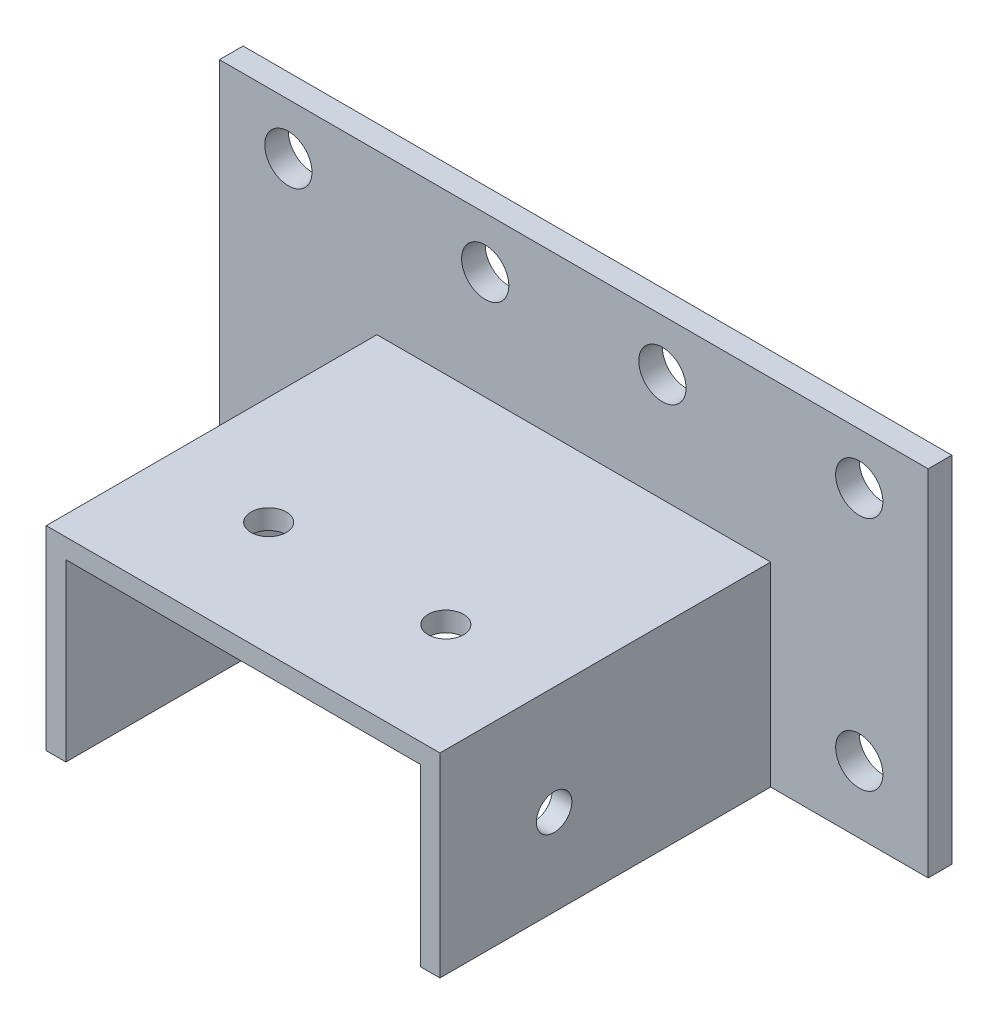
ISO-10303-21;
HEADER;
FILE_DESCRIPTION(('STEP AP214'),'2;1');
FILE_NAME('part.step','',(''),(''),'','','');
FILE_SCHEMA(('AUTOMOTIVE_DESIGN { 1 0 10303 214 1 1 1 1 }'));
ENDSEC;
DATA;
#1=APPLICATION_CONTEXT('core data for automotive mechanical design processes');
#2=APPLICATION_PROTOCOL_DEFINITION('international standard','automotive_design',2000,#1);
#3=PRODUCT_CONTEXT('',#1,'mechanical');
#4=PRODUCT('Part','Part','',(#3));
#5=PRODUCT_RELATED_PRODUCT_CATEGORY('part','',(#4));
#6=PRODUCT_DEFINITION_FORMATION('','',#4);
#7=PRODUCT_DEFINITION_CONTEXT('part definition',#1,'design');
#8=PRODUCT_DEFINITION('design','',#6,#7);
#9=PRODUCT_DEFINITION_SHAPE('','',#8);
#10=(LENGTH_UNIT() NAMED_UNIT(*) SI_UNIT(.MILLI.,.METRE.));
#11=(NAMED_UNIT(*) PLANE_ANGLE_UNIT() SI_UNIT($,.RADIAN.));
#12=(NAMED_UNIT(*) SI_UNIT($,.STERADIAN.) SOLID_ANGLE_UNIT());
#13=UNCERTAINTY_MEASURE_WITH_UNIT(LENGTH_MEASURE(1.E-05),#10,'distance_accuracy_value','');
#14=(GEOMETRIC_REPRESENTATION_CONTEXT(3) GLOBAL_UNCERTAINTY_ASSIGNED_CONTEXT((#13)) GLOBAL_UNIT_ASSIGNED_CONTEXT((#10,
#11,#12)) REPRESENTATION_CONTEXT('',''));
#15=CARTESIAN_POINT('',(0.,0.,0.));
#16=DIRECTION('',(0.,0.,1.));
#17=DIRECTION('',(1.,0.,0.));
#18=AXIS2_PLACEMENT_3D('',#15,#16,#17);
#19=CARTESIAN_POINT('',(-22.5,4.99999999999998,61.));
#20=DIRECTION('',(0.,-1.,0.));
#21=DIRECTION('',(1.,0.,0.));
#22=AXIS2_PLACEMENT_3D('',#19,#20,#21);
#23=CYLINDRICAL_SURFACE('',#22,4.5);
#24=CARTESIAN_POINT('',(-22.5,4.99999999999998,61.));
#25=DIRECTION('',(0.,-1.,0.));
#26=DIRECTION('',(1.,0.,0.));
#27=AXIS2_PLACEMENT_3D('',#24,#25,#26);
#28=CIRCLE('',#27,4.5);
#29=CARTESIAN_POINT('',(-18.,4.99999999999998,61.));
#30=VERTEX_POINT('',#29);
#31=EDGE_CURVE('E333',#30,#30,#28,.T.);
#32=ORIENTED_EDGE('',*,*,#31,.F.);
#33=EDGE_LOOP('',(#32));
#34=FACE_BOUND('',#33,.T.);
#35=CARTESIAN_POINT('',(-22.5,0.,61.));
#36=DIRECTION('',(0.,-1.,0.));
#37=DIRECTION('',(1.,0.,0.));
#38=AXIS2_PLACEMENT_3D('',#35,#36,#37);
#39=CIRCLE('',#38,4.5);
#40=CARTESIAN_POINT('',(-18.,0.,61.));
#41=VERTEX_POINT('',#40);
#42=EDGE_CURVE('E33',#41,#41,#39,.F.);
#43=ORIENTED_EDGE('',*,*,#42,.F.);
#44=EDGE_LOOP('',(#43));
#45=FACE_BOUND('',#44,.T.);
#46=ADVANCED_FACE('F15',(#34,#45),#23,.F.);
#47=CARTESIAN_POINT('',(22.5,4.99999999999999,61.));
#48=DIRECTION('',(0.,-1.,0.));
#49=DIRECTION('',(1.,0.,0.));
#50=AXIS2_PLACEMENT_3D('',#47,#48,#49);
#51=CYLINDRICAL_SURFACE('',#50,4.5);
#52=CARTESIAN_POINT('',(22.5,4.99999999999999,61.));
#53=DIRECTION('',(0.,-1.,0.));
#54=DIRECTION('',(1.,0.,0.));
#55=AXIS2_PLACEMENT_3D('',#52,#53,#54);
#56=CIRCLE('',#55,4.5);
#57=CARTESIAN_POINT('',(27.,4.99999999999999,61.));
#58=VERTEX_POINT('',#57);
#59=EDGE_CURVE('E291',#58,#58,#56,.T.);
#60=ORIENTED_EDGE('',*,*,#59,.F.);
#61=EDGE_LOOP('',(#60));
#62=FACE_BOUND('',#61,.T.);
#63=CARTESIAN_POINT('',(22.5,0.,61.));
#64=DIRECTION('',(0.,-1.,0.));
#65=DIRECTION('',(1.,0.,0.));
#66=AXIS2_PLACEMENT_3D('',#63,#64,#65);
#67=CIRCLE('',#66,4.5);
#68=CARTESIAN_POINT('',(27.,0.,61.));
#69=VERTEX_POINT('',#68);
#70=EDGE_CURVE('E18',#69,#69,#67,.F.);
#71=ORIENTED_EDGE('',*,*,#70,.F.);
#72=EDGE_LOOP('',(#71));
#73=FACE_BOUND('',#72,.T.);
#74=ADVANCED_FACE('F345',(#62,#73),#51,.F.);
#75=CARTESIAN_POINT('',(50.,-22.5,61.));
#76=DIRECTION('',(-1.,0.,0.));
#77=DIRECTION('',(0.,-1.,0.));
#78=AXIS2_PLACEMENT_3D('',#75,#76,#77);
#79=CYLINDRICAL_SURFACE('',#78,4.5);
#80=CARTESIAN_POINT('',(50.,-22.5,61.));
#81=DIRECTION('',(-1.,0.,0.));
#82=DIRECTION('',(0.,-1.,0.));
#83=AXIS2_PLACEMENT_3D('',#80,#81,#82);
#84=CIRCLE('',#83,4.5);
#85=CARTESIAN_POINT('',(50.,-22.5,56.5));
#86=VERTEX_POINT('',#85);
#87=EDGE_CURVE('E289',#86,#86,#84,.T.);
#88=ORIENTED_EDGE('',*,*,#87,.F.);
#89=EDGE_LOOP('',(#88));
#90=FACE_BOUND('',#89,.T.);
#91=CARTESIAN_POINT('',(45.,-22.5,61.));
#92=DIRECTION('',(-1.,0.,0.));
#93=DIRECTION('',(0.,-1.,0.));
#94=AXIS2_PLACEMENT_3D('',#91,#92,#93);
#95=CIRCLE('',#94,4.5);
#96=CARTESIAN_POINT('',(45.,-22.5,56.5));
#97=VERTEX_POINT('',#96);
#98=EDGE_CURVE('E286',#97,#97,#95,.F.);
#99=ORIENTED_EDGE('',*,*,#98,.F.);
#100=EDGE_LOOP('',(#99));
#101=FACE_BOUND('',#100,.T.);
#102=ADVANCED_FACE('F350',(#90,#101),#79,.F.);
#103=CARTESIAN_POINT('',(45.,0.,0.));
#104=DIRECTION('',(0.,-1.,0.));
#105=DIRECTION('',(0.,0.,-1.));
#106=AXIS2_PLACEMENT_3D('',#103,#104,#105);
#107=PLANE('',#106);
#108=ORIENTED_EDGE('',*,*,#42,.T.);
#109=EDGE_LOOP('',(#108));
#110=FACE_BOUND('',#109,.T.);
#111=ORIENTED_EDGE('',*,*,#70,.T.);
#112=EDGE_LOOP('',(#111));
#113=FACE_BOUND('',#112,.T.);
#114=DIRECTION('',(1.,0.,0.));
#115=VECTOR('',#114,1.);
#116=CARTESIAN_POINT('',(0.,0.,90.));
#117=LINE('',#116,#115);
#118=CARTESIAN_POINT('',(-45.,0.,90.));
#119=VERTEX_POINT('',#118);
#120=CARTESIAN_POINT('',(45.,0.,90.));
#121=VERTEX_POINT('',#120);
#122=EDGE_CURVE('E268',#119,#121,#117,.T.);
#123=ORIENTED_EDGE('',*,*,#122,.F.);
#124=DIRECTION('',(0.,0.,-1.));
#125=VECTOR('',#124,1.);
#126=CARTESIAN_POINT('',(-45.,0.,0.));
#127=LINE('',#126,#125);
#128=CARTESIAN_POINT('',(-45.,0.,6.));
#129=VERTEX_POINT('',#128);
#130=EDGE_CURVE('E274',#129,#119,#127,.F.);
#131=ORIENTED_EDGE('',*,*,#130,.F.);
#132=DIRECTION('',(1.,0.,0.));
#133=VECTOR('',#132,1.);
#134=CARTESIAN_POINT('',(0.,0.,6.));
#135=LINE('',#134,#133);
#136=CARTESIAN_POINT('',(45.,0.,6.));
#137=VERTEX_POINT('',#136);
#138=EDGE_CURVE('E280',#137,#129,#135,.F.);
#139=ORIENTED_EDGE('',*,*,#138,.F.);
#140=DIRECTION('',(0.,0.,1.));
#141=VECTOR('',#140,1.);
#142=CARTESIAN_POINT('',(45.,0.,0.));
#143=LINE('',#142,#141);
#144=EDGE_CURVE('E287',#121,#137,#143,.F.);
#145=ORIENTED_EDGE('',*,*,#144,.F.);
#146=EDGE_LOOP('',(#123,#131,#139,#145));
#147=FACE_BOUND('',#146,.T.);
#148=ADVANCED_FACE('F429',(#110,#113,#147),#107,.T.);
#149=CARTESIAN_POINT('',(50.,-22.5,61.));
#150=DIRECTION('',(-1.,0.,0.));
#151=DIRECTION('',(0.,-1.,0.));
#152=AXIS2_PLACEMENT_3D('',#149,#150,#151);
#153=CYLINDRICAL_SURFACE('',#152,4.5);
#154=CARTESIAN_POINT('',(-50.,-22.5,61.));
#155=DIRECTION('',(-1.,0.,0.));
#156=DIRECTION('',(0.,-1.,0.));
#157=AXIS2_PLACEMENT_3D('',#154,#155,#156);
#158=CIRCLE('',#157,4.5);
#159=CARTESIAN_POINT('',(-50.,-22.5,56.5));
#160=VERTEX_POINT('',#159);
#161=EDGE_CURVE('E251',#160,#160,#158,.F.);
#162=ORIENTED_EDGE('',*,*,#161,.F.);
#163=EDGE_LOOP('',(#162));
#164=FACE_BOUND('',#163,.T.);
#165=CARTESIAN_POINT('',(-45.,-22.5,61.));
#166=DIRECTION('',(-1.,0.,0.));
#167=DIRECTION('',(0.,-1.,0.));
#168=AXIS2_PLACEMENT_3D('',#165,#166,#167);
#169=CIRCLE('',#168,4.5);
#170=CARTESIAN_POINT('',(-45.,-22.5,56.5));
#171=VERTEX_POINT('',#170);
#172=EDGE_CURVE('E273',#171,#171,#169,.T.);
#173=ORIENTED_EDGE('',*,*,#172,.F.);
#174=EDGE_LOOP('',(#173));
#175=FACE_BOUND('',#174,.T.);
#176=ADVANCED_FACE('F425',(#164,#175),#153,.F.);
#177=CARTESIAN_POINT('',(-50.,4.99999999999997,6.));
#178=DIRECTION('',(0.,1.,0.));
#179=DIRECTION('',(0.,0.,1.));
#180=AXIS2_PLACEMENT_3D('',#177,#178,#179);
#181=PLANE('',#180);
#182=ORIENTED_EDGE('',*,*,#59,.T.);
#183=EDGE_LOOP('',(#182));
#184=FACE_BOUND('',#183,.T.);
#185=ORIENTED_EDGE('',*,*,#31,.T.);
#186=EDGE_LOOP('',(#185));
#187=FACE_BOUND('',#186,.T.);
#188=DIRECTION('',(1.,0.,0.));
#189=VECTOR('',#188,1.);
#190=CARTESIAN_POINT('',(0.,4.99999999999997,6.));
#191=LINE('',#190,#189);
#192=CARTESIAN_POINT('',(-50.,4.99999999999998,6.));
#193=VERTEX_POINT('',#192);
#194=CARTESIAN_POINT('',(50.,4.99999999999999,6.));
#195=VERTEX_POINT('',#194);
#196=EDGE_CURVE('E243',#193,#195,#191,.T.);
#197=ORIENTED_EDGE('',*,*,#196,.F.);
#198=DIRECTION('',(0.,0.,1.));
#199=VECTOR('',#198,1.);
#200=CARTESIAN_POINT('',(-50.,4.99999999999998,6.));
#201=LINE('',#200,#199);
#202=CARTESIAN_POINT('',(-50.,4.99999999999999,90.));
#203=VERTEX_POINT('',#202);
#204=EDGE_CURVE('E252',#203,#193,#201,.F.);
#205=ORIENTED_EDGE('',*,*,#204,.F.);
#206=DIRECTION('',(1.,0.,0.));
#207=VECTOR('',#206,1.);
#208=CARTESIAN_POINT('',(0.,5.,90.));
#209=LINE('',#208,#207);
#210=CARTESIAN_POINT('',(50.,4.99999999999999,90.));
#211=VERTEX_POINT('',#210);
#212=EDGE_CURVE('E258',#211,#203,#209,.F.);
#213=ORIENTED_EDGE('',*,*,#212,.F.);
#214=DIRECTION('',(0.,0.,-1.));
#215=VECTOR('',#214,1.);
#216=CARTESIAN_POINT('',(50.,5.,6.));
#217=LINE('',#216,#215);
#218=EDGE_CURVE('E290',#195,#211,#217,.F.);
#219=ORIENTED_EDGE('',*,*,#218,.F.);
#220=EDGE_LOOP('',(#197,#205,#213,#219));
#221=FACE_BOUND('',#220,.T.);
#222=ADVANCED_FACE('F340',(#184,#187,#221),#181,.T.);
#223=CARTESIAN_POINT('',(50.,5.,6.));
#224=DIRECTION('',(1.,0.,0.));
#225=DIRECTION('',(0.,0.,-1.));
#226=AXIS2_PLACEMENT_3D('',#223,#224,#225);
#227=PLANE('',#226);
#228=ORIENTED_EDGE('',*,*,#87,.T.);
#229=EDGE_LOOP('',(#228));
#230=FACE_BOUND('',#229,.T.);
#231=DIRECTION('',(0.,1.,0.));
#232=VECTOR('',#231,1.);
#233=CARTESIAN_POINT('',(50.,3.64825119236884,6.));
#234=LINE('',#233,#232);
#235=CARTESIAN_POINT('',(50.,-44.5,6.));
#236=VERTEX_POINT('',#235);
#237=EDGE_CURVE('E249',#195,#236,#234,.F.);
#238=ORIENTED_EDGE('',*,*,#237,.F.);
#239=ORIENTED_EDGE('',*,*,#218,.T.);
#240=DIRECTION('',(0.,1.,0.));
#241=VECTOR('',#240,1.);
#242=CARTESIAN_POINT('',(50.,-10.0012886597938,90.));
#243=LINE('',#242,#241);
#244=CARTESIAN_POINT('',(50.,-44.5,90.));
#245=VERTEX_POINT('',#244);
#246=EDGE_CURVE('E261',#245,#211,#243,.T.);
#247=ORIENTED_EDGE('',*,*,#246,.F.);
#248=DIRECTION('',(0.,0.,-1.));
#249=VECTOR('',#248,1.);
#250=CARTESIAN_POINT('',(50.,-44.5,0.));
#251=LINE('',#250,#249);
#252=EDGE_CURVE('E234',#236,#245,#251,.F.);
#253=ORIENTED_EDGE('',*,*,#252,.F.);
#254=EDGE_LOOP('',(#238,#239,#247,#253));
#255=FACE_BOUND('',#254,.T.);
#256=ADVANCED_FACE('F418',(#230,#255),#227,.T.);
#257=CARTESIAN_POINT('',(45.,-44.5,0.));
#258=DIRECTION('',(-1.,0.,0.));
#259=DIRECTION('',(0.,0.,1.));
#260=AXIS2_PLACEMENT_3D('',#257,#258,#259);
#261=PLANE('',#260);
#262=ORIENTED_EDGE('',*,*,#98,.T.);
#263=EDGE_LOOP('',(#262));
#264=FACE_BOUND('',#263,.T.);
#265=DIRECTION('',(0.,1.,0.));
#266=VECTOR('',#265,1.);
#267=CARTESIAN_POINT('',(45.,-10.0012886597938,90.));
#268=LINE('',#267,#266);
#269=CARTESIAN_POINT('',(45.,-44.5,90.));
#270=VERTEX_POINT('',#269);
#271=EDGE_CURVE('E265',#121,#270,#268,.F.);
#272=ORIENTED_EDGE('',*,*,#271,.F.);
#273=ORIENTED_EDGE('',*,*,#144,.T.);
#274=DIRECTION('',(0.,1.,0.));
#275=VECTOR('',#274,1.);
#276=CARTESIAN_POINT('',(45.,-22.25,6.));
#277=LINE('',#276,#275);
#278=CARTESIAN_POINT('',(45.,-44.5,6.));
#279=VERTEX_POINT('',#278);
#280=EDGE_CURVE('E282',#279,#137,#277,.T.);
#281=ORIENTED_EDGE('',*,*,#280,.F.);
#282=DIRECTION('',(0.,0.,-1.));
#283=VECTOR('',#282,1.);
#284=CARTESIAN_POINT('',(45.,-44.5,0.));
#285=LINE('',#284,#283);
#286=EDGE_CURVE('E227',#270,#279,#285,.T.);
#287=ORIENTED_EDGE('',*,*,#286,.F.);
#288=EDGE_LOOP('',(#272,#273,#281,#287));
#289=FACE_BOUND('',#288,.T.);
#290=ADVANCED_FACE('F414',(#264,#289),#261,.T.);
#291=CARTESIAN_POINT('',(0.,-22.25,6.));
#292=DIRECTION('',(0.,0.,1.));
#293=DIRECTION('',(1.,0.,0.));
#294=AXIS2_PLACEMENT_3D('',#291,#292,#293);
#295=PLANE('',#294);
#296=ORIENTED_EDGE('',*,*,#280,.T.);
#297=ORIENTED_EDGE('',*,*,#138,.T.);
#298=DIRECTION('',(0.,1.,0.));
#299=VECTOR('',#298,1.);
#300=CARTESIAN_POINT('',(-45.,0.,6.));
#301=LINE('',#300,#299);
#302=CARTESIAN_POINT('',(-45.,-44.5,6.));
#303=VERTEX_POINT('',#302);
#304=EDGE_CURVE('E277',#303,#129,#301,.T.);
#305=ORIENTED_EDGE('',*,*,#304,.F.);
#306=DIRECTION('',(1.,0.,0.));
#307=VECTOR('',#306,1.);
#308=CARTESIAN_POINT('',(-45.,-44.5,6.));
#309=LINE('',#308,#307);
#310=EDGE_CURVE('E224',#279,#303,#309,.F.);
#311=ORIENTED_EDGE('',*,*,#310,.F.);
#312=EDGE_LOOP('',(#296,#297,#305,#311));
#313=FACE_BOUND('',#312,.T.);
#314=ADVANCED_FACE('F410',(#313),#295,.T.);
#315=CARTESIAN_POINT('',(-45.,0.,0.));
#316=DIRECTION('',(1.,0.,0.));
#317=DIRECTION('',(0.,0.,-1.));
#318=AXIS2_PLACEMENT_3D('',#315,#316,#317);
#319=PLANE('',#318);
#320=ORIENTED_EDGE('',*,*,#172,.T.);
#321=EDGE_LOOP('',(#320));
#322=FACE_BOUND('',#321,.T.);
#323=DIRECTION('',(0.,1.,0.));
#324=VECTOR('',#323,1.);
#325=CARTESIAN_POINT('',(-45.,-10.0012886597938,90.));
#326=LINE('',#325,#324);
#327=CARTESIAN_POINT('',(-45.,-44.5,90.));
#328=VERTEX_POINT('',#327);
#329=EDGE_CURVE('E270',#328,#119,#326,.T.);
#330=ORIENTED_EDGE('',*,*,#329,.F.);
#331=DIRECTION('',(0.,0.,-1.));
#332=VECTOR('',#331,1.);
#333=CARTESIAN_POINT('',(-45.,-44.5,0.));
#334=LINE('',#333,#332);
#335=EDGE_CURVE('E222',#303,#328,#334,.F.);
#336=ORIENTED_EDGE('',*,*,#335,.F.);
#337=ORIENTED_EDGE('',*,*,#304,.T.);
#338=ORIENTED_EDGE('',*,*,#130,.T.);
#339=EDGE_LOOP('',(#330,#336,#337,#338));
#340=FACE_BOUND('',#339,.T.);
#341=ADVANCED_FACE('F406',(#322,#340),#319,.T.);
#342=CARTESIAN_POINT('',(0.,-10.0012886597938,90.));
#343=DIRECTION('',(0.,0.,1.));
#344=DIRECTION('',(1.,0.,0.));
#345=AXIS2_PLACEMENT_3D('',#342,#343,#344);
#346=PLANE('',#345);
#347=ORIENTED_EDGE('',*,*,#212,.T.);
#348=DIRECTION('',(0.,1.,0.));
#349=VECTOR('',#348,1.);
#350=CARTESIAN_POINT('',(-50.,-44.5,90.));
#351=LINE('',#350,#349);
#352=CARTESIAN_POINT('',(-50.,-44.5,90.));
#353=VERTEX_POINT('',#352);
#354=EDGE_CURVE('E255',#353,#203,#351,.T.);
#355=ORIENTED_EDGE('',*,*,#354,.F.);
#356=DIRECTION('',(1.,0.,0.));
#357=VECTOR('',#356,1.);
#358=CARTESIAN_POINT('',(-45.,-44.5,90.));
#359=LINE('',#358,#357);
#360=EDGE_CURVE('E220',#328,#353,#359,.F.);
#361=ORIENTED_EDGE('',*,*,#360,.F.);
#362=ORIENTED_EDGE('',*,*,#329,.T.);
#363=ORIENTED_EDGE('',*,*,#122,.T.);
#364=ORIENTED_EDGE('',*,*,#271,.T.);
#365=DIRECTION('',(1.,0.,0.));
#366=VECTOR('',#365,1.);
#367=CARTESIAN_POINT('',(-45.,-44.5,90.));
#368=LINE('',#367,#366);
#369=EDGE_CURVE('E230',#245,#270,#368,.F.);
#370=ORIENTED_EDGE('',*,*,#369,.F.);
#371=ORIENTED_EDGE('',*,*,#246,.T.);
#372=EDGE_LOOP('',(#347,#355,#361,#362,#363,#364,#370,#371));
#373=FACE_BOUND('',#372,.T.);
#374=ADVANCED_FACE('F402',(#373),#346,.T.);
#375=CARTESIAN_POINT('',(-50.,-44.5,6.));
#376=DIRECTION('',(-1.,0.,0.));
#377=DIRECTION('',(0.,0.,1.));
#378=AXIS2_PLACEMENT_3D('',#375,#376,#377);
#379=PLANE('',#378);
#380=ORIENTED_EDGE('',*,*,#161,.T.);
#381=EDGE_LOOP('',(#380));
#382=FACE_BOUND('',#381,.T.);
#383=DIRECTION('',(0.,1.,0.));
#384=VECTOR('',#383,1.);
#385=CARTESIAN_POINT('',(-50.,3.64825119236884,6.));
#386=LINE('',#385,#384);
#387=CARTESIAN_POINT('',(-50.,-44.5,6.));
#388=VERTEX_POINT('',#387);
#389=EDGE_CURVE('E246',#388,#193,#386,.T.);
#390=ORIENTED_EDGE('',*,*,#389,.F.);
#391=DIRECTION('',(0.,0.,-1.));
#392=VECTOR('',#391,1.);
#393=CARTESIAN_POINT('',(-50.,-44.5,0.));
#394=LINE('',#393,#392);
#395=EDGE_CURVE('E216',#353,#388,#394,.T.);
#396=ORIENTED_EDGE('',*,*,#395,.F.);
#397=ORIENTED_EDGE('',*,*,#354,.T.);
#398=ORIENTED_EDGE('',*,*,#204,.T.);
#399=EDGE_LOOP('',(#390,#396,#397,#398));
#400=FACE_BOUND('',#399,.T.);
#401=ADVANCED_FACE('F398',(#382,#400),#379,.T.);
#402=CARTESIAN_POINT('',(0.,3.64825119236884,6.));
#403=DIRECTION('',(0.,0.,1.));
#404=DIRECTION('',(1.,0.,0.));
#405=AXIS2_PLACEMENT_3D('',#402,#403,#404);
#406=PLANE('',#405);
#407=CARTESIAN_POINT('',(-72.5,-27.5,6.));
#408=DIRECTION('',(0.,0.,1.));
#409=DIRECTION('',(1.,0.,0.));
#410=AXIS2_PLACEMENT_3D('',#407,#408,#409);
#411=CIRCLE('',#410,6.);
#412=CARTESIAN_POINT('',(-66.5,-27.5,6.));
#413=VERTEX_POINT('',#412);
#414=EDGE_CURVE('E203',#413,#413,#411,.F.);
#415=ORIENTED_EDGE('',*,*,#414,.T.);
#416=EDGE_LOOP('',(#415));
#417=FACE_BOUND('',#416,.T.);
#418=CARTESIAN_POINT('',(-72.5,32.5,6.));
#419=DIRECTION('',(0.,0.,1.));
#420=DIRECTION('',(1.,0.,0.));
#421=AXIS2_PLACEMENT_3D('',#418,#419,#420);
#422=CIRCLE('',#421,6.);
#423=CARTESIAN_POINT('',(-66.5,32.5,6.));
#424=VERTEX_POINT('',#423);
#425=EDGE_CURVE('E310',#424,#424,#422,.F.);
#426=ORIENTED_EDGE('',*,*,#425,.T.);
#427=EDGE_LOOP('',(#426));
#428=FACE_BOUND('',#427,.T.);
#429=CARTESIAN_POINT('',(-22.5,32.5,6.));
#430=DIRECTION('',(0.,0.,1.));
#431=DIRECTION('',(1.,0.,0.));
#432=AXIS2_PLACEMENT_3D('',#429,#430,#431);
#433=CIRCLE('',#432,6.);
#434=CARTESIAN_POINT('',(-16.5,32.5,6.));
#435=VERTEX_POINT('',#434);
#436=EDGE_CURVE('E313',#435,#435,#433,.F.);
#437=ORIENTED_EDGE('',*,*,#436,.T.);
#438=EDGE_LOOP('',(#437));
#439=FACE_BOUND('',#438,.T.);
#440=CARTESIAN_POINT('',(22.5,32.5,6.));
#441=DIRECTION('',(0.,0.,1.));
#442=DIRECTION('',(1.,0.,0.));
#443=AXIS2_PLACEMENT_3D('',#440,#441,#442);
#444=CIRCLE('',#443,6.);
#445=CARTESIAN_POINT('',(28.5,32.5,6.));
#446=VERTEX_POINT('',#445);
#447=EDGE_CURVE('E316',#446,#446,#444,.F.);
#448=ORIENTED_EDGE('',*,*,#447,.T.);
#449=EDGE_LOOP('',(#448));
#450=FACE_BOUND('',#449,.T.);
#451=CARTESIAN_POINT('',(72.5,32.5,6.));
#452=DIRECTION('',(0.,0.,1.));
#453=DIRECTION('',(1.,0.,0.));
#454=AXIS2_PLACEMENT_3D('',#451,#452,#453);
#455=CIRCLE('',#454,6.);
#456=CARTESIAN_POINT('',(78.5,32.5,6.));
#457=VERTEX_POINT('',#456);
#458=EDGE_CURVE('E320',#457,#457,#455,.F.);
#459=ORIENTED_EDGE('',*,*,#458,.T.);
#460=EDGE_LOOP('',(#459));
#461=FACE_BOUND('',#460,.T.);
#462=CARTESIAN_POINT('',(72.5,-27.5,6.));
#463=DIRECTION('',(0.,0.,1.));
#464=DIRECTION('',(1.,0.,0.));
#465=AXIS2_PLACEMENT_3D('',#462,#463,#464);
#466=CIRCLE('',#465,6.);
#467=CARTESIAN_POINT('',(78.5,-27.5,6.));
#468=VERTEX_POINT('',#467);
#469=EDGE_CURVE('E205',#468,#468,#466,.F.);
#470=ORIENTED_EDGE('',*,*,#469,.T.);
#471=EDGE_LOOP('',(#470));
#472=FACE_BOUND('',#471,.T.);
#473=ORIENTED_EDGE('',*,*,#389,.T.);
#474=ORIENTED_EDGE('',*,*,#196,.T.);
#475=ORIENTED_EDGE('',*,*,#237,.T.);
#476=DIRECTION('',(1.,0.,0.));
#477=VECTOR('',#476,1.);
#478=CARTESIAN_POINT('',(-45.,-44.5,6.));
#479=LINE('',#478,#477);
#480=CARTESIAN_POINT('',(90.,-44.5,6.));
#481=VERTEX_POINT('',#480);
#482=EDGE_CURVE('E237',#481,#236,#479,.F.);
#483=ORIENTED_EDGE('',*,*,#482,.F.);
#484=DIRECTION('',(0.,1.,0.));
#485=VECTOR('',#484,1.);
#486=CARTESIAN_POINT('',(90.,45.5,6.));
#487=LINE('',#486,#485);
#488=CARTESIAN_POINT('',(90.,45.5,6.));
#489=VERTEX_POINT('',#488);
#490=EDGE_CURVE('E214',#489,#481,#487,.F.);
#491=ORIENTED_EDGE('',*,*,#490,.F.);
#492=DIRECTION('',(1.,0.,0.));
#493=VECTOR('',#492,1.);
#494=CARTESIAN_POINT('',(-90.,45.5,6.));
#495=LINE('',#494,#493);
#496=CARTESIAN_POINT('',(-90.,45.5,6.));
#497=VERTEX_POINT('',#496);
#498=EDGE_CURVE('E210',#497,#489,#495,.T.);
#499=ORIENTED_EDGE('',*,*,#498,.F.);
#500=DIRECTION('',(0.,1.,0.));
#501=VECTOR('',#500,1.);
#502=CARTESIAN_POINT('',(-90.,-44.5,6.));
#503=LINE('',#502,#501);
#504=CARTESIAN_POINT('',(-90.,-44.5,6.));
#505=VERTEX_POINT('',#504);
#506=EDGE_CURVE('E176',#505,#497,#503,.T.);
#507=ORIENTED_EDGE('',*,*,#506,.F.);
#508=DIRECTION('',(1.,0.,0.));
#509=VECTOR('',#508,1.);
#510=CARTESIAN_POINT('',(-45.,-44.5,6.));
#511=LINE('',#510,#509);
#512=EDGE_CURVE('E240',#388,#505,#511,.F.);
#513=ORIENTED_EDGE('',*,*,#512,.F.);
#514=EDGE_LOOP('',(#473,#474,#475,#483,#491,#499,#507,#513));
#515=FACE_BOUND('',#514,.T.);
#516=ADVANCED_FACE('F394',(#417,#428,#439,#450,#461,#472,#515),#406,.T.);
#517=CARTESIAN_POINT('',(-45.,-44.5,0.));
#518=DIRECTION('',(0.,-1.,0.));
#519=DIRECTION('',(0.,0.,-1.));
#520=AXIS2_PLACEMENT_3D('',#517,#518,#519);
#521=PLANE('',#520);
#522=ORIENTED_EDGE('',*,*,#360,.T.);
#523=ORIENTED_EDGE('',*,*,#395,.T.);
#524=ORIENTED_EDGE('',*,*,#512,.T.);
#525=DIRECTION('',(0.,0.,1.));
#526=VECTOR('',#525,1.);
#527=CARTESIAN_POINT('',(-90.,-44.5,0.));
#528=LINE('',#527,#526);
#529=CARTESIAN_POINT('',(-90.,-44.5,0.));
#530=VERTEX_POINT('',#529);
#531=EDGE_CURVE('E180',#530,#505,#528,.T.);
#532=ORIENTED_EDGE('',*,*,#531,.F.);
#533=DIRECTION('',(1.,0.,0.));
#534=VECTOR('',#533,1.);
#535=CARTESIAN_POINT('',(0.,-44.5,0.));
#536=LINE('',#535,#534);
#537=CARTESIAN_POINT('',(90.,-44.5,0.));
#538=VERTEX_POINT('',#537);
#539=EDGE_CURVE('E189',#530,#538,#536,.T.);
#540=ORIENTED_EDGE('',*,*,#539,.T.);
#541=DIRECTION('',(0.,0.,-1.));
#542=VECTOR('',#541,1.);
#543=CARTESIAN_POINT('',(90.,-44.5,0.));
#544=LINE('',#543,#542);
#545=EDGE_CURVE('E212',#481,#538,#544,.T.);
#546=ORIENTED_EDGE('',*,*,#545,.F.);
#547=ORIENTED_EDGE('',*,*,#482,.T.);
#548=ORIENTED_EDGE('',*,*,#252,.T.);
#549=ORIENTED_EDGE('',*,*,#369,.T.);
#550=ORIENTED_EDGE('',*,*,#286,.T.);
#551=ORIENTED_EDGE('',*,*,#310,.T.);
#552=ORIENTED_EDGE('',*,*,#335,.T.);
#553=EDGE_LOOP('',(#522,#523,#524,#532,#540,#546,#547,#548,#549,#550,#551,#552));
#554=FACE_BOUND('',#553,.T.);
#555=ADVANCED_FACE('F390',(#554),#521,.T.);
#556=CARTESIAN_POINT('',(90.,45.5,0.));
#557=DIRECTION('',(1.,0.,0.));
#558=DIRECTION('',(0.,0.,-1.));
#559=AXIS2_PLACEMENT_3D('',#556,#557,#558);
#560=PLANE('',#559);
#561=DIRECTION('',(0.,1.,0.));
#562=VECTOR('',#561,1.);
#563=CARTESIAN_POINT('',(90.,3.64825119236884,0.));
#564=LINE('',#563,#562);
#565=CARTESIAN_POINT('',(90.,45.5,0.));
#566=VERTEX_POINT('',#565);
#567=EDGE_CURVE('E197',#538,#566,#564,.T.);
#568=ORIENTED_EDGE('',*,*,#567,.T.);
#569=DIRECTION('',(0.,0.,1.));
#570=VECTOR('',#569,1.);
#571=CARTESIAN_POINT('',(90.,45.5,0.));
#572=LINE('',#571,#570);
#573=EDGE_CURVE('E196',#489,#566,#572,.F.);
#574=ORIENTED_EDGE('',*,*,#573,.F.);
#575=ORIENTED_EDGE('',*,*,#490,.T.);
#576=ORIENTED_EDGE('',*,*,#545,.T.);
#577=EDGE_LOOP('',(#568,#574,#575,#576));
#578=FACE_BOUND('',#577,.T.);
#579=ADVANCED_FACE('F387',(#578),#560,.T.);
#580=CARTESIAN_POINT('',(-90.,45.5,0.));
#581=DIRECTION('',(0.,1.,0.));
#582=DIRECTION('',(0.,0.,1.));
#583=AXIS2_PLACEMENT_3D('',#580,#581,#582);
#584=PLANE('',#583);
#585=DIRECTION('',(1.,0.,0.));
#586=VECTOR('',#585,1.);
#587=CARTESIAN_POINT('',(0.,45.5,0.));
#588=LINE('',#587,#586);
#589=CARTESIAN_POINT('',(-90.,45.5,0.));
#590=VERTEX_POINT('',#589);
#591=EDGE_CURVE('E186',#566,#590,#588,.F.);
#592=ORIENTED_EDGE('',*,*,#591,.T.);
#593=DIRECTION('',(0.,0.,1.));
#594=VECTOR('',#593,1.);
#595=CARTESIAN_POINT('',(-90.,45.5,0.));
#596=LINE('',#595,#594);
#597=EDGE_CURVE('E170',#497,#590,#596,.F.);
#598=ORIENTED_EDGE('',*,*,#597,.F.);
#599=ORIENTED_EDGE('',*,*,#498,.T.);
#600=ORIENTED_EDGE('',*,*,#573,.T.);
#601=EDGE_LOOP('',(#592,#598,#599,#600));
#602=FACE_BOUND('',#601,.T.);
#603=ADVANCED_FACE('F194',(#602),#584,.T.);
#604=CARTESIAN_POINT('',(-90.,-44.5,0.));
#605=DIRECTION('',(-1.,0.,0.));
#606=DIRECTION('',(0.,0.,1.));
#607=AXIS2_PLACEMENT_3D('',#604,#605,#606);
#608=PLANE('',#607);
#609=DIRECTION('',(0.,1.,0.));
#610=VECTOR('',#609,1.);
#611=CARTESIAN_POINT('',(-90.,3.64825119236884,0.));
#612=LINE('',#611,#610);
#613=EDGE_CURVE('E174',#590,#530,#612,.F.);
#614=ORIENTED_EDGE('',*,*,#613,.T.);
#615=ORIENTED_EDGE('',*,*,#531,.T.);
#616=ORIENTED_EDGE('',*,*,#506,.T.);
#617=ORIENTED_EDGE('',*,*,#597,.T.);
#618=EDGE_LOOP('',(#614,#615,#616,#617));
#619=FACE_BOUND('',#618,.T.);
#620=ADVANCED_FACE('F172',(#619),#608,.T.);
#621=CARTESIAN_POINT('',(72.5,-27.5,0.));
#622=DIRECTION('',(0.,0.,1.));
#623=DIRECTION('',(1.,0.,0.));
#624=AXIS2_PLACEMENT_3D('',#621,#622,#623);
#625=CYLINDRICAL_SURFACE('',#624,6.);
#626=CARTESIAN_POINT('',(72.5,-27.5,0.));
#627=DIRECTION('',(0.,0.,1.));
#628=DIRECTION('',(1.,0.,0.));
#629=AXIS2_PLACEMENT_3D('',#626,#627,#628);
#630=CIRCLE('',#629,6.);
#631=CARTESIAN_POINT('',(78.5,-27.5,0.));
#632=VERTEX_POINT('',#631);
#633=EDGE_CURVE('E192',#632,#632,#630,.F.);
#634=ORIENTED_EDGE('',*,*,#633,.T.);
#635=EDGE_LOOP('',(#634));
#636=FACE_BOUND('',#635,.T.);
#637=ORIENTED_EDGE('',*,*,#469,.F.);
#638=EDGE_LOOP('',(#637));
#639=FACE_BOUND('',#638,.T.);
#640=ADVANCED_FACE('F378',(#636,#639),#625,.F.);
#641=CARTESIAN_POINT('',(72.5,32.5,0.));
#642=DIRECTION('',(0.,0.,1.));
#643=DIRECTION('',(1.,0.,0.));
#644=AXIS2_PLACEMENT_3D('',#641,#642,#643);
#645=CYLINDRICAL_SURFACE('',#644,6.);
#646=CARTESIAN_POINT('',(72.5,32.5,0.));
#647=DIRECTION('',(0.,0.,1.));
#648=DIRECTION('',(1.,0.,0.));
#649=AXIS2_PLACEMENT_3D('',#646,#647,#648);
#650=CIRCLE('',#649,6.);
#651=CARTESIAN_POINT('',(78.5,32.5,0.));
#652=VERTEX_POINT('',#651);
#653=EDGE_CURVE('E302',#652,#652,#650,.F.);
#654=ORIENTED_EDGE('',*,*,#653,.T.);
#655=EDGE_LOOP('',(#654));
#656=FACE_BOUND('',#655,.T.);
#657=ORIENTED_EDGE('',*,*,#458,.F.);
#658=EDGE_LOOP('',(#657));
#659=FACE_BOUND('',#658,.T.);
#660=ADVANCED_FACE('F374',(#656,#659),#645,.F.);
#661=CARTESIAN_POINT('',(22.5,32.5,0.));
#662=DIRECTION('',(0.,0.,1.));
#663=DIRECTION('',(1.,0.,0.));
#664=AXIS2_PLACEMENT_3D('',#661,#662,#663);
#665=CYLINDRICAL_SURFACE('',#664,6.);
#666=CARTESIAN_POINT('',(22.5,32.5,0.));
#667=DIRECTION('',(0.,0.,1.));
#668=DIRECTION('',(1.,0.,0.));
#669=AXIS2_PLACEMENT_3D('',#666,#667,#668);
#670=CIRCLE('',#669,6.);
#671=CARTESIAN_POINT('',(28.5,32.5,0.));
#672=VERTEX_POINT('',#671);
#673=EDGE_CURVE('E298',#672,#672,#670,.F.);
#674=ORIENTED_EDGE('',*,*,#673,.T.);
#675=EDGE_LOOP('',(#674));
#676=FACE_BOUND('',#675,.T.);
#677=ORIENTED_EDGE('',*,*,#447,.F.);
#678=EDGE_LOOP('',(#677));
#679=FACE_BOUND('',#678,.T.);
#680=ADVANCED_FACE('F370',(#676,#679),#665,.F.);
#681=CARTESIAN_POINT('',(-22.5,32.5,0.));
#682=DIRECTION('',(0.,0.,1.));
#683=DIRECTION('',(1.,0.,0.));
#684=AXIS2_PLACEMENT_3D('',#681,#682,#683);
#685=CYLINDRICAL_SURFACE('',#684,6.);
#686=CARTESIAN_POINT('',(-22.5,32.5,0.));
#687=DIRECTION('',(0.,0.,1.));
#688=DIRECTION('',(1.,0.,0.));
#689=AXIS2_PLACEMENT_3D('',#686,#687,#688);
#690=CIRCLE('',#689,6.);
#691=CARTESIAN_POINT('',(-16.5,32.5,0.));
#692=VERTEX_POINT('',#691);
#693=EDGE_CURVE('E295',#692,#692,#690,.F.);
#694=ORIENTED_EDGE('',*,*,#693,.T.);
#695=EDGE_LOOP('',(#694));
#696=FACE_BOUND('',#695,.T.);
#697=ORIENTED_EDGE('',*,*,#436,.F.);
#698=EDGE_LOOP('',(#697));
#699=FACE_BOUND('',#698,.T.);
#700=ADVANCED_FACE('F366',(#696,#699),#685,.F.);
#701=CARTESIAN_POINT('',(-72.5,32.5,0.));
#702=DIRECTION('',(0.,0.,1.));
#703=DIRECTION('',(1.,0.,0.));
#704=AXIS2_PLACEMENT_3D('',#701,#702,#703);
#705=CYLINDRICAL_SURFACE('',#704,6.);
#706=CARTESIAN_POINT('',(-72.5,32.5,0.));
#707=DIRECTION('',(0.,0.,1.));
#708=DIRECTION('',(1.,0.,0.));
#709=AXIS2_PLACEMENT_3D('',#706,#707,#708);
#710=CIRCLE('',#709,6.);
#711=CARTESIAN_POINT('',(-66.5,32.5,0.));
#712=VERTEX_POINT('',#711);
#713=EDGE_CURVE('E23',#712,#712,#710,.F.);
#714=ORIENTED_EDGE('',*,*,#713,.T.);
#715=EDGE_LOOP('',(#714));
#716=FACE_BOUND('',#715,.T.);
#717=ORIENTED_EDGE('',*,*,#425,.F.);
#718=EDGE_LOOP('',(#717));
#719=FACE_BOUND('',#718,.T.);
#720=ADVANCED_FACE('F359',(#716,#719),#705,.F.);
#721=CARTESIAN_POINT('',(-72.5,-27.5,0.));
#722=DIRECTION('',(0.,0.,1.));
#723=DIRECTION('',(1.,0.,0.));
#724=AXIS2_PLACEMENT_3D('',#721,#722,#723);
#725=CYLINDRICAL_SURFACE('',#724,6.);
#726=CARTESIAN_POINT('',(-72.5,-27.5,0.));
#727=DIRECTION('',(0.,0.,1.));
#728=DIRECTION('',(1.,0.,0.));
#729=AXIS2_PLACEMENT_3D('',#726,#727,#728);
#730=CIRCLE('',#729,6.);
#731=CARTESIAN_POINT('',(-66.5,-27.5,0.));
#732=VERTEX_POINT('',#731);
#733=EDGE_CURVE('E9',#732,#732,#730,.F.);
#734=ORIENTED_EDGE('',*,*,#733,.T.);
#735=EDGE_LOOP('',(#734));
#736=FACE_BOUND('',#735,.T.);
#737=ORIENTED_EDGE('',*,*,#414,.F.);
#738=EDGE_LOOP('',(#737));
#739=FACE_BOUND('',#738,.T.);
#740=ADVANCED_FACE('F353',(#736,#739),#725,.F.);
#741=CARTESIAN_POINT('',(0.,3.64825119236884,0.));
#742=DIRECTION('',(0.,0.,1.));
#743=DIRECTION('',(1.,0.,0.));
#744=AXIS2_PLACEMENT_3D('',#741,#742,#743);
#745=PLANE('',#744);
#746=ORIENTED_EDGE('',*,*,#733,.F.);
#747=EDGE_LOOP('',(#746));
#748=FACE_BOUND('',#747,.T.);
#749=ORIENTED_EDGE('',*,*,#713,.F.);
#750=EDGE_LOOP('',(#749));
#751=FACE_BOUND('',#750,.T.);
#752=ORIENTED_EDGE('',*,*,#693,.F.);
#753=EDGE_LOOP('',(#752));
#754=FACE_BOUND('',#753,.T.);
#755=ORIENTED_EDGE('',*,*,#673,.F.);
#756=EDGE_LOOP('',(#755));
#757=FACE_BOUND('',#756,.T.);
#758=ORIENTED_EDGE('',*,*,#653,.F.);
#759=EDGE_LOOP('',(#758));
#760=FACE_BOUND('',#759,.T.);
#761=ORIENTED_EDGE('',*,*,#633,.F.);
#762=EDGE_LOOP('',(#761));
#763=FACE_BOUND('',#762,.T.);
#764=ORIENTED_EDGE('',*,*,#591,.F.);
#765=ORIENTED_EDGE('',*,*,#567,.F.);
#766=ORIENTED_EDGE('',*,*,#539,.F.);
#767=ORIENTED_EDGE('',*,*,#613,.F.);
#768=EDGE_LOOP('',(#764,#765,#766,#767));
#769=FACE_BOUND('',#768,.T.);
#770=ADVANCED_FACE('F184',(#748,#751,#754,#757,#760,#763,#769),#745,.F.);
#771=CLOSED_SHELL('',(#46,#74,#102,#148,#176,#222,#256,#290,#314,#341,#374,#401,#516,#555,#579,
#603,#620,#640,#660,#680,#700,#720,#740,#770));
#772=MANIFOLD_SOLID_BREP('B1',#771);
#773=ADVANCED_BREP_SHAPE_REPRESENTATION('',(#18,#772),#14);
#774=SHAPE_DEFINITION_REPRESENTATION(#9,#773);
ENDSEC;
END-ISO-10303-21;
